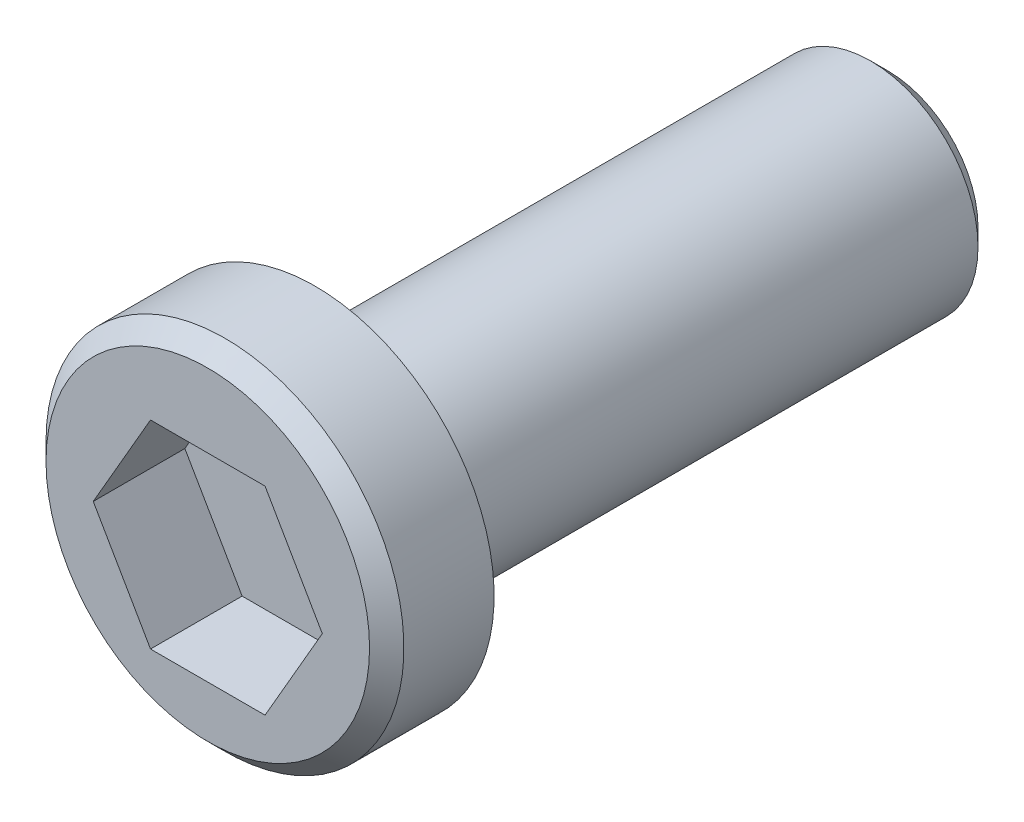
from build123d import *

# Parameters (mm, degrees)
SKETCH1_R          = 4.7625
EXTRUDE1_DEPTH     = 25.4
SKETCH3_R          = 7.9375
EXTRUDE3_DEPTH     = 4.7625
CHAMFER1_SIZE      = 0.762
CUT_EXTRUDE1_DEPTH = 4.064


with BuildPart() as part:
    # Sketch1 → Extrude1 (new body)
    with BuildSketch(Plane.XY):
        Circle(SKETCH1_R)
    extrude(amount=EXTRUDE1_DEPTH)

    # Sketch3 → Extrude3 (add)
    with BuildSketch(Plane.XY.offset(25.4)):
        with Locations(Location((0, 0.491553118, 0), (0, 0, 180))):
            Circle(SKETCH3_R)
    extrude(amount=EXTRUDE3_DEPTH)

    # Chamfer1
    chamfer1_edges = [part.edges().sort_by_distance(p)[0] for p in [
        (7.9375, 0.491553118, 30.1625),
        (-4.7625, 0, 0),
    ]]
    chamfer(chamfer1_edges, length=CHAMFER1_SIZE)

    # Sketch4 → Cut-Extrude1 (cut)
    with BuildSketch(Plane.XY.offset(30.1625)):
        Polygon((5.08, 0), (2.54, 4.399409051), (-2.54, 4.399409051), (-5.08, 0), (-2.54, -4.399409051), (2.54, -4.399409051), align=None)
    extrude(amount=-CUT_EXTRUDE1_DEPTH, mode=Mode.SUBTRACT)


solid = part.part
